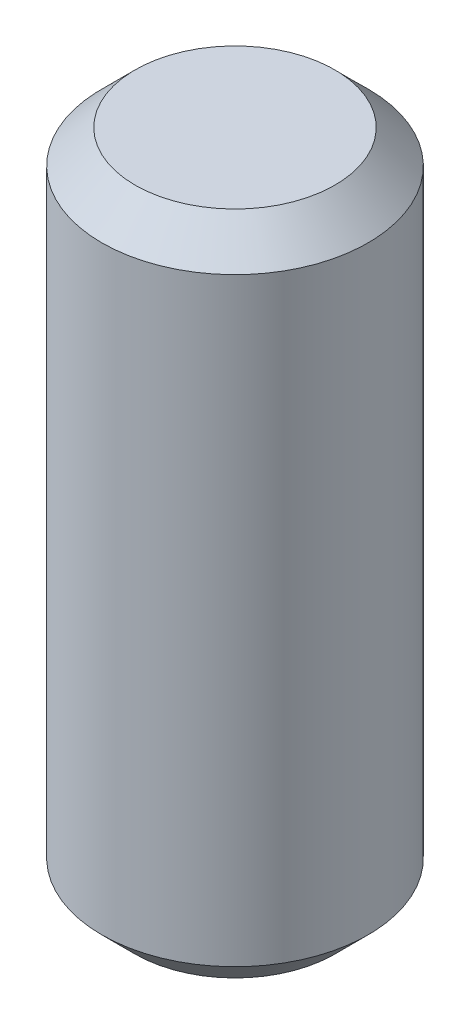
ISO-10303-21;
HEADER;
FILE_DESCRIPTION(('STEP AP214'),'2;1');
FILE_NAME('part.step','',(''),(''),'','','');
FILE_SCHEMA(('AUTOMOTIVE_DESIGN { 1 0 10303 214 1 1 1 1 }'));
ENDSEC;
DATA;
#1=APPLICATION_CONTEXT('core data for automotive mechanical design processes');
#2=APPLICATION_PROTOCOL_DEFINITION('international standard','automotive_design',2000,#1);
#3=PRODUCT_CONTEXT('',#1,'mechanical');
#4=PRODUCT('Part','Part','',(#3));
#5=PRODUCT_RELATED_PRODUCT_CATEGORY('part','',(#4));
#6=PRODUCT_DEFINITION_FORMATION('','',#4);
#7=PRODUCT_DEFINITION_CONTEXT('part definition',#1,'design');
#8=PRODUCT_DEFINITION('design','',#6,#7);
#9=PRODUCT_DEFINITION_SHAPE('','',#8);
#10=(LENGTH_UNIT() NAMED_UNIT(*) SI_UNIT(.MILLI.,.METRE.));
#11=(NAMED_UNIT(*) PLANE_ANGLE_UNIT() SI_UNIT($,.RADIAN.));
#12=(NAMED_UNIT(*) SI_UNIT($,.STERADIAN.) SOLID_ANGLE_UNIT());
#13=UNCERTAINTY_MEASURE_WITH_UNIT(LENGTH_MEASURE(1.E-05),#10,'distance_accuracy_value','');
#14=(GEOMETRIC_REPRESENTATION_CONTEXT(3) GLOBAL_UNCERTAINTY_ASSIGNED_CONTEXT((#13)) GLOBAL_UNIT_ASSIGNED_CONTEXT((#10,
#11,#12)) REPRESENTATION_CONTEXT('',''));
#15=CARTESIAN_POINT('',(0.,0.,0.));
#16=DIRECTION('',(0.,0.,1.));
#17=DIRECTION('',(1.,0.,0.));
#18=AXIS2_PLACEMENT_3D('',#15,#16,#17);
#19=CARTESIAN_POINT('',(3.,20.,0.));
#20=DIRECTION('',(0.,-1.,0.));
#21=DIRECTION('',(0.,0.,-1.));
#22=AXIS2_PLACEMENT_3D('',#19,#20,#21);
#23=PLANE('',#22);
#24=CARTESIAN_POINT('',(0.,20.,0.));
#25=DIRECTION('',(0.,1.,0.));
#26=DIRECTION('',(0.,0.,1.));
#27=AXIS2_PLACEMENT_3D('',#24,#25,#26);
#28=CIRCLE('',#27,3.);
#29=CARTESIAN_POINT('',(0.,20.,3.));
#30=VERTEX_POINT('',#29);
#31=EDGE_CURVE('E10',#30,#30,#28,.T.);
#32=ORIENTED_EDGE('',*,*,#31,.T.);
#33=EDGE_LOOP('',(#32));
#34=FACE_BOUND('',#33,.T.);
#35=ADVANCED_FACE('F28',(#34),#23,.F.);
#36=CARTESIAN_POINT('',(0.,19.,0.));
#37=DIRECTION('',(0.,-1.,0.));
#38=DIRECTION('',(0.,0.,-1.));
#39=AXIS2_PLACEMENT_3D('',#36,#37,#38);
#40=CONICAL_SURFACE('',#39,4.,0.785398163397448);
#41=ORIENTED_EDGE('',*,*,#31,.F.);
#42=EDGE_LOOP('',(#41));
#43=FACE_BOUND('',#42,.T.);
#44=CARTESIAN_POINT('',(0.,19.,0.));
#45=DIRECTION('',(0.,1.,0.));
#46=DIRECTION('',(0.,0.,1.));
#47=AXIS2_PLACEMENT_3D('',#44,#45,#46);
#48=CIRCLE('',#47,4.);
#49=CARTESIAN_POINT('',(0.,19.,4.));
#50=VERTEX_POINT('',#49);
#51=EDGE_CURVE('E34',#50,#50,#48,.T.);
#52=ORIENTED_EDGE('',*,*,#51,.T.);
#53=EDGE_LOOP('',(#52));
#54=FACE_BOUND('',#53,.T.);
#55=ADVANCED_FACE('F60',(#43,#54),#40,.T.);
#56=CARTESIAN_POINT('',(0.,32.8092102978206,0.));
#57=DIRECTION('',(0.,1.,0.));
#58=DIRECTION('',(0.,0.,1.));
#59=AXIS2_PLACEMENT_3D('',#56,#57,#58);
#60=CYLINDRICAL_SURFACE('',#59,4.);
#61=ORIENTED_EDGE('',*,*,#51,.F.);
#62=EDGE_LOOP('',(#61));
#63=FACE_BOUND('',#62,.T.);
#64=CARTESIAN_POINT('',(0.,1.,0.));
#65=DIRECTION('',(0.,1.,0.));
#66=DIRECTION('',(0.,0.,1.));
#67=AXIS2_PLACEMENT_3D('',#64,#65,#66);
#68=CIRCLE('',#67,4.);
#69=CARTESIAN_POINT('',(0.,1.,4.));
#70=VERTEX_POINT('',#69);
#71=EDGE_CURVE('E38',#70,#70,#68,.T.);
#72=ORIENTED_EDGE('',*,*,#71,.T.);
#73=EDGE_LOOP('',(#72));
#74=FACE_BOUND('',#73,.T.);
#75=ADVANCED_FACE('F56',(#63,#74),#60,.T.);
#76=CARTESIAN_POINT('',(0.,0.,0.));
#77=DIRECTION('',(0.,1.,0.));
#78=DIRECTION('',(0.,0.,1.));
#79=AXIS2_PLACEMENT_3D('',#76,#77,#78);
#80=CONICAL_SURFACE('',#79,3.,0.785398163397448);
#81=ORIENTED_EDGE('',*,*,#71,.F.);
#82=EDGE_LOOP('',(#81));
#83=FACE_BOUND('',#82,.T.);
#84=CARTESIAN_POINT('',(0.,0.,0.));
#85=DIRECTION('',(0.,1.,0.));
#86=DIRECTION('',(0.,0.,1.));
#87=AXIS2_PLACEMENT_3D('',#84,#85,#86);
#88=CIRCLE('',#87,3.);
#89=CARTESIAN_POINT('',(0.,0.,3.));
#90=VERTEX_POINT('',#89);
#91=EDGE_CURVE('E42',#90,#90,#88,.T.);
#92=ORIENTED_EDGE('',*,*,#91,.T.);
#93=EDGE_LOOP('',(#92));
#94=FACE_BOUND('',#93,.T.);
#95=ADVANCED_FACE('F48',(#83,#94),#80,.T.);
#96=CARTESIAN_POINT('',(3.,0.,0.));
#97=DIRECTION('',(0.,1.,0.));
#98=DIRECTION('',(0.,0.,1.));
#99=AXIS2_PLACEMENT_3D('',#96,#97,#98);
#100=PLANE('',#99);
#101=ORIENTED_EDGE('',*,*,#91,.F.);
#102=EDGE_LOOP('',(#101));
#103=FACE_BOUND('',#102,.T.);
#104=ADVANCED_FACE('F50',(#103),#100,.F.);
#105=CLOSED_SHELL('',(#35,#55,#75,#95,#104));
#106=MANIFOLD_SOLID_BREP('B2',#105);
#107=ADVANCED_BREP_SHAPE_REPRESENTATION('',(#18,#106),#14);
#108=SHAPE_DEFINITION_REPRESENTATION(#9,#107);
ENDSEC;
END-ISO-10303-21;
